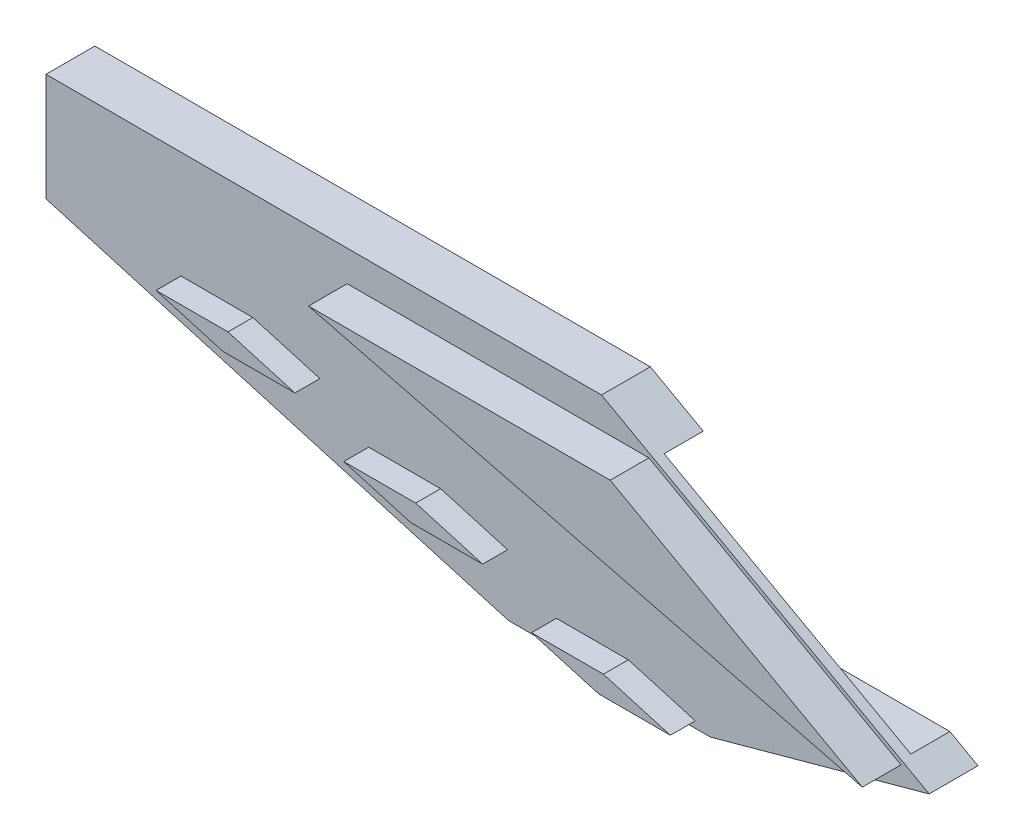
ISO-10303-21;
HEADER;
FILE_DESCRIPTION(('STEP AP214'),'2;1');
FILE_NAME('part.step','',(''),(''),'','','');
FILE_SCHEMA(('AUTOMOTIVE_DESIGN { 1 0 10303 214 1 1 1 1 }'));
ENDSEC;
DATA;
#1=APPLICATION_CONTEXT('core data for automotive mechanical design processes');
#2=APPLICATION_PROTOCOL_DEFINITION('international standard','automotive_design',2000,#1);
#3=PRODUCT_CONTEXT('',#1,'mechanical');
#4=PRODUCT('Part','Part','',(#3));
#5=PRODUCT_RELATED_PRODUCT_CATEGORY('part','',(#4));
#6=PRODUCT_DEFINITION_FORMATION('','',#4);
#7=PRODUCT_DEFINITION_CONTEXT('part definition',#1,'design');
#8=PRODUCT_DEFINITION('design','',#6,#7);
#9=PRODUCT_DEFINITION_SHAPE('','',#8);
#10=(LENGTH_UNIT() NAMED_UNIT(*) SI_UNIT(.MILLI.,.METRE.));
#11=(NAMED_UNIT(*) PLANE_ANGLE_UNIT() SI_UNIT($,.RADIAN.));
#12=(NAMED_UNIT(*) SI_UNIT($,.STERADIAN.) SOLID_ANGLE_UNIT());
#13=UNCERTAINTY_MEASURE_WITH_UNIT(LENGTH_MEASURE(1.E-05),#10,'distance_accuracy_value','');
#14=(GEOMETRIC_REPRESENTATION_CONTEXT(3) GLOBAL_UNCERTAINTY_ASSIGNED_CONTEXT((#13)) GLOBAL_UNIT_ASSIGNED_CONTEXT((#10,
#11,#12)) REPRESENTATION_CONTEXT('',''));
#15=CARTESIAN_POINT('',(0.,0.,0.));
#16=DIRECTION('',(0.,0.,1.));
#17=DIRECTION('',(1.,0.,0.));
#18=AXIS2_PLACEMENT_3D('',#15,#16,#17);
#19=CARTESIAN_POINT('',(7.36236862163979,13.2769199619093,1.27540173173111));
#20=DIRECTION('',(-0.484953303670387,-0.87454004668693,0.));
#21=DIRECTION('',(0.87454004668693,-0.484953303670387,0.));
#22=AXIS2_PLACEMENT_3D('',#19,#20,#21);
#23=PLANE('',#22);
#24=DIRECTION('',(0.,0.,1.));
#25=VECTOR('',#24,1.);
#26=CARTESIAN_POINT('',(30.6308957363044,0.373967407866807,-2.5));
#27=LINE('',#26,#25);
#28=CARTESIAN_POINT('',(30.6308957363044,0.373967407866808,-2.5));
#29=VERTEX_POINT('',#28);
#30=CARTESIAN_POINT('',(30.6308957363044,0.373967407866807,-0.5));
#31=VERTEX_POINT('',#30);
#32=EDGE_CURVE('E251',#29,#31,#27,.T.);
#33=ORIENTED_EDGE('',*,*,#32,.F.);
#34=DIRECTION('',(-0.874539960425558,0.484953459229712,0.));
#35=VECTOR('',#34,1.);
#36=CARTESIAN_POINT('',(27.9258733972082,1.87396740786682,-2.5));
#37=LINE('',#36,#35);
#38=CARTESIAN_POINT('',(27.9258733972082,1.87396740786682,-2.5));
#39=VERTEX_POINT('',#38);
#40=EDGE_CURVE('E236',#29,#39,#37,.T.);
#41=ORIENTED_EDGE('',*,*,#40,.T.);
#42=DIRECTION('',(0.,0.,1.));
#43=VECTOR('',#42,1.);
#44=CARTESIAN_POINT('',(27.9258733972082,1.87396740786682,-2.5));
#45=LINE('',#44,#43);
#46=CARTESIAN_POINT('',(27.9258733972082,1.87396740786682,0.));
#47=VERTEX_POINT('',#46);
#48=EDGE_CURVE('E393',#39,#47,#45,.T.);
#49=ORIENTED_EDGE('',*,*,#48,.T.);
#50=DIRECTION('',(0.874539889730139,-0.484953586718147,0.));
#51=VECTOR('',#50,1.);
#52=CARTESIAN_POINT('',(27.9258733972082,1.87396740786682,0.));
#53=LINE('',#52,#51);
#54=CARTESIAN_POINT('',(30.4036142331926,0.5,0.));
#55=VERTEX_POINT('',#54);
#56=EDGE_CURVE('E368',#47,#55,#53,.T.);
#57=ORIENTED_EDGE('',*,*,#56,.T.);
#58=DIRECTION('',(0.87454004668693,-0.484953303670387,0.));
#59=VECTOR('',#58,1.);
#60=CARTESIAN_POINT('',(30.4036142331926,0.500000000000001,0.));
#61=LINE('',#60,#59);
#62=CARTESIAN_POINT('',(44.6914697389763,-7.42295647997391,0.));
#63=VERTEX_POINT('',#62);
#64=EDGE_CURVE('E253',#55,#63,#61,.T.);
#65=ORIENTED_EDGE('',*,*,#64,.T.);
#66=DIRECTION('',(0.,0.,1.));
#67=VECTOR('',#66,1.);
#68=CARTESIAN_POINT('',(44.6914697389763,-7.42295647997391,-0.5));
#69=LINE('',#68,#67);
#70=CARTESIAN_POINT('',(44.6914697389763,-7.42295647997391,-2.5));
#71=VERTEX_POINT('',#70);
#72=EDGE_CURVE('E422',#71,#63,#69,.T.);
#73=ORIENTED_EDGE('',*,*,#72,.F.);
#74=DIRECTION('',(-0.87454004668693,0.484953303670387,0.));
#75=VECTOR('',#74,1.);
#76=CARTESIAN_POINT('',(41.4509888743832,-5.62603259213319,-2.5));
#77=LINE('',#76,#75);
#78=CARTESIAN_POINT('',(43.2543378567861,-6.6260325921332,-2.5));
#79=VERTEX_POINT('',#78);
#80=EDGE_CURVE('E376',#71,#79,#77,.T.);
#81=ORIENTED_EDGE('',*,*,#80,.T.);
#82=DIRECTION('',(0.,0.,1.));
#83=VECTOR('',#82,1.);
#84=CARTESIAN_POINT('',(43.2543378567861,-6.6260325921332,-2.5));
#85=LINE('',#84,#83);
#86=CARTESIAN_POINT('',(43.2543378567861,-6.6260325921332,-0.5));
#87=VERTEX_POINT('',#86);
#88=EDGE_CURVE('E260',#79,#87,#85,.T.);
#89=ORIENTED_EDGE('',*,*,#88,.T.);
#90=DIRECTION('',(-0.87454004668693,0.484953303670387,0.));
#91=VECTOR('',#90,1.);
#92=CARTESIAN_POINT('',(44.6914697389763,-7.42295647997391,-0.5));
#93=LINE('',#92,#91);
#94=CARTESIAN_POINT('',(32.4342439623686,-0.626032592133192,-0.5));
#95=VERTEX_POINT('',#94);
#96=EDGE_CURVE('E401',#87,#95,#93,.T.);
#97=ORIENTED_EDGE('',*,*,#96,.T.);
#98=DIRECTION('',(-0.874539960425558,0.484953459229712,0.));
#99=VECTOR('',#98,1.);
#100=CARTESIAN_POINT('',(32.4342439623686,-0.626032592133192,-0.5));
#101=LINE('',#100,#99);
#102=EDGE_CURVE('E265',#95,#31,#101,.T.);
#103=ORIENTED_EDGE('',*,*,#102,.T.);
#104=EDGE_LOOP('',(#33,#41,#49,#57,#65,#73,#81,#89,#97,#103));
#105=FACE_BOUND('',#104,.T.);
#106=ADVANCED_FACE('F45',(#105),#23,.F.);
#107=CARTESIAN_POINT('',(23.1646220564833,-10.5,-1.5));
#108=DIRECTION('',(0.278176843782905,0.960529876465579,0.));
#109=DIRECTION('',(-0.960529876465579,0.278176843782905,0.));
#110=AXIS2_PLACEMENT_3D('',#107,#108,#109);
#111=PLANE('',#110);
#112=DIRECTION('',(0.,0.,1.));
#113=VECTOR('',#112,1.);
#114=CARTESIAN_POINT('',(9.78801822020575,-6.6260325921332,-2.5));
#115=LINE('',#114,#113);
#116=CARTESIAN_POINT('',(9.78801822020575,-6.6260325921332,-2.5));
#117=VERTEX_POINT('',#116);
#118=CARTESIAN_POINT('',(9.78801822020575,-6.6260325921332,-0.5));
#119=VERTEX_POINT('',#118);
#120=EDGE_CURVE('E258',#117,#119,#115,.T.);
#121=ORIENTED_EDGE('',*,*,#120,.F.);
#122=DIRECTION('',(0.960529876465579,-0.278176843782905,0.));
#123=VECTOR('',#122,1.);
#124=CARTESIAN_POINT('',(6.3350712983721,-5.62603259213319,-2.5));
#125=LINE('',#124,#123);
#126=CARTESIAN_POINT('',(14.9674386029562,-8.12603259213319,-2.5));
#127=VERTEX_POINT('',#126);
#128=EDGE_CURVE('E379',#117,#127,#125,.T.);
#129=ORIENTED_EDGE('',*,*,#128,.T.);
#130=DIRECTION('',(0.,0.,1.));
#131=VECTOR('',#130,1.);
#132=CARTESIAN_POINT('',(14.9674386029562,-8.12603259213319,-2.5));
#133=LINE('',#132,#131);
#134=CARTESIAN_POINT('',(14.9674386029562,-8.1260325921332,-0.5));
#135=VERTEX_POINT('',#134);
#136=EDGE_CURVE('E371',#127,#135,#133,.T.);
#137=ORIENTED_EDGE('',*,*,#136,.T.);
#138=DIRECTION('',(0.96052987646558,-0.278176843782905,0.));
#139=VECTOR('',#138,1.);
#140=CARTESIAN_POINT('',(-1.01303723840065,-3.49796381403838,-0.5));
#141=LINE('',#140,#139);
#142=CARTESIAN_POINT('',(23.1646220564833,-10.5,-0.5));
#143=VERTEX_POINT('',#142);
#144=EDGE_CURVE('E414',#135,#143,#141,.T.);
#145=ORIENTED_EDGE('',*,*,#144,.T.);
#146=DIRECTION('',(0.,0.,1.));
#147=VECTOR('',#146,1.);
#148=CARTESIAN_POINT('',(23.1646220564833,-10.5,-1.5));
#149=LINE('',#148,#147);
#150=CARTESIAN_POINT('',(23.1646220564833,-10.5,0.));
#151=VERTEX_POINT('',#150);
#152=EDGE_CURVE('E411',#143,#151,#149,.T.);
#153=ORIENTED_EDGE('',*,*,#152,.T.);
#154=DIRECTION('',(0.960529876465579,-0.278176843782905,0.));
#155=VECTOR('',#154,1.);
#156=CARTESIAN_POINT('',(23.1646220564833,-10.5,0.));
#157=LINE('',#156,#155);
#158=CARTESIAN_POINT('',(-0.5,-3.64654334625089,0.));
#159=VERTEX_POINT('',#158);
#160=EDGE_CURVE('E407',#159,#151,#157,.T.);
#161=ORIENTED_EDGE('',*,*,#160,.F.);
#162=DIRECTION('',(0.,0.,1.));
#163=VECTOR('',#162,1.);
#164=CARTESIAN_POINT('',(-0.5,-3.64654334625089,-1.5));
#165=LINE('',#164,#163);
#166=CARTESIAN_POINT('',(-0.5,-3.64654334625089,-0.5));
#167=VERTEX_POINT('',#166);
#168=EDGE_CURVE('E410',#167,#159,#165,.T.);
#169=ORIENTED_EDGE('',*,*,#168,.F.);
#170=EDGE_CURVE('E417',#167,#119,#141,.T.);
#171=ORIENTED_EDGE('',*,*,#170,.T.);
#172=EDGE_LOOP('',(#121,#129,#137,#145,#153,#161,#169,#171));
#173=FACE_BOUND('',#172,.T.);
#174=ADVANCED_FACE('F486',(#173),#111,.F.);
#175=CARTESIAN_POINT('',(-0.5,-10.5,0.));
#176=DIRECTION('',(1.,0.,0.));
#177=DIRECTION('',(0.,0.,1.));
#178=AXIS2_PLACEMENT_3D('',#175,#176,#177);
#179=PLANE('',#178);
#180=DIRECTION('',(0.,0.,1.));
#181=VECTOR('',#180,1.);
#182=CARTESIAN_POINT('',(-0.499999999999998,0.373967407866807,-2.5));
#183=LINE('',#182,#181);
#184=CARTESIAN_POINT('',(-0.499999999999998,0.373967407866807,-2.5));
#185=VERTEX_POINT('',#184);
#186=CARTESIAN_POINT('',(-0.499999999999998,0.373967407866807,-0.5));
#187=VERTEX_POINT('',#186);
#188=EDGE_CURVE('E238',#185,#187,#183,.T.);
#189=ORIENTED_EDGE('',*,*,#188,.T.);
#190=DIRECTION('',(0.,-1.,0.));
#191=VECTOR('',#190,1.);
#192=CARTESIAN_POINT('',(-0.5,0.5,-0.5));
#193=LINE('',#192,#191);
#194=EDGE_CURVE('E396',#187,#167,#193,.T.);
#195=ORIENTED_EDGE('',*,*,#194,.T.);
#196=ORIENTED_EDGE('',*,*,#168,.T.);
#197=DIRECTION('',(0.,1.,0.));
#198=VECTOR('',#197,1.);
#199=CARTESIAN_POINT('',(-0.5,-10.5,0.));
#200=LINE('',#199,#198);
#201=CARTESIAN_POINT('',(-0.499999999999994,1.87396740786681,0.));
#202=VERTEX_POINT('',#201);
#203=EDGE_CURVE('E425',#159,#202,#200,.T.);
#204=ORIENTED_EDGE('',*,*,#203,.T.);
#205=DIRECTION('',(0.,0.,1.));
#206=VECTOR('',#205,1.);
#207=CARTESIAN_POINT('',(-0.499999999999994,1.87396740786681,-2.5));
#208=LINE('',#207,#206);
#209=CARTESIAN_POINT('',(-0.499999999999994,1.87396740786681,-2.5));
#210=VERTEX_POINT('',#209);
#211=EDGE_CURVE('E246',#210,#202,#208,.T.);
#212=ORIENTED_EDGE('',*,*,#211,.F.);
#213=DIRECTION('',(0.,-1.,0.));
#214=VECTOR('',#213,1.);
#215=CARTESIAN_POINT('',(-0.5,-0.626032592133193,-2.5));
#216=LINE('',#215,#214);
#217=EDGE_CURVE('E233',#210,#185,#216,.T.);
#218=ORIENTED_EDGE('',*,*,#217,.T.);
#219=EDGE_LOOP('',(#189,#195,#196,#204,#212,#218));
#220=FACE_BOUND('',#219,.T.);
#221=ADVANCED_FACE('F243',(#220),#179,.F.);
#222=CARTESIAN_POINT('',(0.,0.,-2.5));
#223=DIRECTION('',(0.,0.,1.));
#224=DIRECTION('',(-1.,0.,0.));
#225=AXIS2_PLACEMENT_3D('',#222,#223,#224);
#226=PLANE('',#225);
#227=DIRECTION('',(-1.,0.,0.));
#228=VECTOR('',#227,1.);
#229=CARTESIAN_POINT('',(24.7373461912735,0.373967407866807,-2.5));
#230=LINE('',#229,#228);
#231=EDGE_CURVE('E60',#29,#185,#230,.T.);
#232=ORIENTED_EDGE('',*,*,#231,.T.);
#233=ORIENTED_EDGE('',*,*,#217,.F.);
#234=DIRECTION('',(-1.,0.,0.));
#235=VECTOR('',#234,1.);
#236=CARTESIAN_POINT('',(-0.499999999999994,1.87396740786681,-2.5));
#237=LINE('',#236,#235);
#238=EDGE_CURVE('E390',#39,#210,#237,.T.);
#239=ORIENTED_EDGE('',*,*,#238,.F.);
#240=ORIENTED_EDGE('',*,*,#40,.F.);
#241=EDGE_LOOP('',(#232,#233,#239,#240));
#242=FACE_BOUND('',#241,.T.);
#243=ADVANCED_FACE('F232',(#242),#226,.F.);
#244=CARTESIAN_POINT('',(0.,0.,-2.5));
#245=DIRECTION('',(0.,0.,1.));
#246=DIRECTION('',(-1.,0.,0.));
#247=AXIS2_PLACEMENT_3D('',#244,#245,#246);
#248=PLANE('',#247);
#249=DIRECTION('',(1.,0.,0.));
#250=VECTOR('',#249,1.);
#251=CARTESIAN_POINT('',(9.78801822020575,-6.6260325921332,-2.5));
#252=LINE('',#251,#250);
#253=EDGE_CURVE('E68',#117,#79,#252,.T.);
#254=ORIENTED_EDGE('',*,*,#253,.T.);
#255=ORIENTED_EDGE('',*,*,#80,.F.);
#256=DIRECTION('',(0.964218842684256,0.265107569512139,0.));
#257=VECTOR('',#256,1.);
#258=CARTESIAN_POINT('',(44.6914697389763,-7.42295647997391,-2.5));
#259=LINE('',#258,#257);
#260=CARTESIAN_POINT('',(42.134321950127,-8.1260325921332,-2.5));
#261=VERTEX_POINT('',#260);
#262=EDGE_CURVE('E382',#261,#71,#259,.T.);
#263=ORIENTED_EDGE('',*,*,#262,.F.);
#264=DIRECTION('',(1.,0.,0.));
#265=VECTOR('',#264,1.);
#266=CARTESIAN_POINT('',(14.9674386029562,-8.12603259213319,-2.5));
#267=LINE('',#266,#265);
#268=EDGE_CURVE('E384',#127,#261,#267,.T.);
#269=ORIENTED_EDGE('',*,*,#268,.F.);
#270=ORIENTED_EDGE('',*,*,#128,.F.);
#271=EDGE_LOOP('',(#254,#255,#263,#269,#270));
#272=FACE_BOUND('',#271,.T.);
#273=ADVANCED_FACE('F505',(#272),#248,.F.);
#274=CARTESIAN_POINT('',(0.,0.,-0.5));
#275=DIRECTION('',(0.,0.,1.));
#276=DIRECTION('',(-1.,0.,0.));
#277=AXIS2_PLACEMENT_3D('',#274,#275,#276);
#278=PLANE('',#277);
#279=ORIENTED_EDGE('',*,*,#170,.F.);
#280=ORIENTED_EDGE('',*,*,#194,.F.);
#281=DIRECTION('',(-1.,0.,0.));
#282=VECTOR('',#281,1.);
#283=CARTESIAN_POINT('',(-0.499999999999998,0.373967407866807,-0.5));
#284=LINE('',#283,#282);
#285=EDGE_CURVE('E239',#31,#187,#284,.T.);
#286=ORIENTED_EDGE('',*,*,#285,.F.);
#287=ORIENTED_EDGE('',*,*,#102,.F.);
#288=ORIENTED_EDGE('',*,*,#96,.F.);
#289=DIRECTION('',(1.,0.,0.));
#290=VECTOR('',#289,1.);
#291=CARTESIAN_POINT('',(9.78801822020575,-6.6260325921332,-0.5));
#292=LINE('',#291,#290);
#293=EDGE_CURVE('E263',#119,#87,#292,.T.);
#294=ORIENTED_EDGE('',*,*,#293,.F.);
#295=EDGE_LOOP('',(#279,#280,#286,#287,#288,#294));
#296=FACE_BOUND('',#295,.T.);
#297=ADVANCED_FACE('F510',(#296),#278,.F.);
#298=DIRECTION('',(1.,0.,0.));
#299=VECTOR('',#298,1.);
#300=CARTESIAN_POINT('',(14.9674386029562,-8.12603259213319,-0.5));
#301=LINE('',#300,#299);
#302=CARTESIAN_POINT('',(42.134321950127,-8.1260325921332,-0.5));
#303=VERTEX_POINT('',#302);
#304=EDGE_CURVE('E247',#135,#303,#301,.T.);
#305=ORIENTED_EDGE('',*,*,#304,.T.);
#306=DIRECTION('',(0.964218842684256,0.265107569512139,0.));
#307=VECTOR('',#306,1.);
#308=CARTESIAN_POINT('',(33.6278108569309,-10.4648589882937,-0.5));
#309=LINE('',#308,#307);
#310=CARTESIAN_POINT('',(33.5,-10.5,-0.5));
#311=VERTEX_POINT('',#310);
#312=EDGE_CURVE('E400',#311,#303,#309,.T.);
#313=ORIENTED_EDGE('',*,*,#312,.F.);
#314=DIRECTION('',(1.,0.,0.));
#315=VECTOR('',#314,1.);
#316=CARTESIAN_POINT('',(23.1646220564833,-10.5,-0.5));
#317=LINE('',#316,#315);
#318=EDGE_CURVE('E397',#143,#311,#317,.T.);
#319=ORIENTED_EDGE('',*,*,#318,.F.);
#320=ORIENTED_EDGE('',*,*,#144,.F.);
#321=EDGE_LOOP('',(#305,#313,#319,#320));
#322=FACE_BOUND('',#321,.T.);
#323=ADVANCED_FACE('F522',(#322),#278,.F.);
#324=CARTESIAN_POINT('',(44.6914697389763,-7.42295647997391,-0.5));
#325=DIRECTION('',(-0.265107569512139,0.964218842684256,0.));
#326=DIRECTION('',(-0.964218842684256,-0.265107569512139,0.));
#327=AXIS2_PLACEMENT_3D('',#324,#325,#326);
#328=PLANE('',#327);
#329=ORIENTED_EDGE('',*,*,#312,.T.);
#330=DIRECTION('',(0.,0.,1.));
#331=VECTOR('',#330,1.);
#332=CARTESIAN_POINT('',(42.134321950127,-8.1260325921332,-2.5));
#333=LINE('',#332,#331);
#334=EDGE_CURVE('E374',#261,#303,#333,.T.);
#335=ORIENTED_EDGE('',*,*,#334,.F.);
#336=ORIENTED_EDGE('',*,*,#262,.T.);
#337=ORIENTED_EDGE('',*,*,#72,.T.);
#338=DIRECTION('',(0.964218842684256,0.265107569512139,0.));
#339=VECTOR('',#338,1.);
#340=CARTESIAN_POINT('',(44.6914697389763,-7.42295647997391,0.));
#341=LINE('',#340,#339);
#342=CARTESIAN_POINT('',(33.5,-10.5,0.));
#343=VERTEX_POINT('',#342);
#344=EDGE_CURVE('E420',#343,#63,#341,.T.);
#345=ORIENTED_EDGE('',*,*,#344,.F.);
#346=DIRECTION('',(0.,0.,-1.));
#347=VECTOR('',#346,1.);
#348=CARTESIAN_POINT('',(33.5,-10.5,0.));
#349=LINE('',#348,#347);
#350=EDGE_CURVE('E429',#343,#311,#349,.T.);
#351=ORIENTED_EDGE('',*,*,#350,.T.);
#352=EDGE_LOOP('',(#329,#335,#336,#337,#345,#351));
#353=FACE_BOUND('',#352,.T.);
#354=ADVANCED_FACE('F499',(#353),#328,.F.);
#355=CARTESIAN_POINT('',(33.5,-10.5,0.));
#356=DIRECTION('',(0.,1.,0.));
#357=DIRECTION('',(0.,0.,-1.));
#358=AXIS2_PLACEMENT_3D('',#355,#356,#357);
#359=PLANE('',#358);
#360=ORIENTED_EDGE('',*,*,#318,.T.);
#361=ORIENTED_EDGE('',*,*,#350,.F.);
#362=DIRECTION('',(-1.,0.,0.));
#363=VECTOR('',#362,1.);
#364=CARTESIAN_POINT('',(33.5,-10.5,0.));
#365=LINE('',#364,#363);
#366=EDGE_CURVE('E427',#343,#151,#365,.T.);
#367=ORIENTED_EDGE('',*,*,#366,.T.);
#368=ORIENTED_EDGE('',*,*,#152,.F.);
#369=EDGE_LOOP('',(#360,#361,#367,#368));
#370=FACE_BOUND('',#369,.T.);
#371=ADVANCED_FACE('F497',(#370),#359,.F.);
#372=CARTESIAN_POINT('',(0.,0.,0.));
#373=DIRECTION('',(0.,0.,-1.));
#374=DIRECTION('',(1.,0.,0.));
#375=AXIS2_PLACEMENT_3D('',#372,#373,#374);
#376=PLANE('',#375);
#377=ORIENTED_EDGE('',*,*,#366,.F.);
#378=ORIENTED_EDGE('',*,*,#344,.T.);
#379=ORIENTED_EDGE('',*,*,#64,.F.);
#380=ORIENTED_EDGE('',*,*,#56,.F.);
#381=DIRECTION('',(1.,0.,0.));
#382=VECTOR('',#381,1.);
#383=CARTESIAN_POINT('',(-0.499999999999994,1.87396740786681,0.));
#384=LINE('',#383,#382);
#385=EDGE_CURVE('E358',#202,#47,#384,.T.);
#386=ORIENTED_EDGE('',*,*,#385,.F.);
#387=ORIENTED_EDGE('',*,*,#203,.F.);
#388=ORIENTED_EDGE('',*,*,#160,.T.);
#389=EDGE_LOOP('',(#377,#378,#379,#380,#386,#387,#388));
#390=FACE_BOUND('',#389,.T.);
#391=DIRECTION('',(1.,0.,0.));
#392=VECTOR('',#391,1.);
#393=CARTESIAN_POINT('',(6.4079260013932,-3.61277337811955,0.));
#394=LINE('',#393,#392);
#395=CARTESIAN_POINT('',(6.4079260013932,-3.61277337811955,0.));
#396=VERTEX_POINT('',#395);
#397=CARTESIAN_POINT('',(10.0872601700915,-3.61277337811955,0.));
#398=VERTEX_POINT('',#397);
#399=EDGE_CURVE('E351',#396,#398,#394,.T.);
#400=ORIENTED_EDGE('',*,*,#399,.T.);
#401=DIRECTION('',(0.960529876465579,-0.278176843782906,0.));
#402=VECTOR('',#401,1.);
#403=CARTESIAN_POINT('',(10.0872601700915,-3.61277337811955,0.));
#404=LINE('',#403,#402);
#405=CARTESIAN_POINT('',(13.5134463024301,-4.60502324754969,0.));
#406=VERTEX_POINT('',#405);
#407=EDGE_CURVE('E320',#398,#406,#404,.T.);
#408=ORIENTED_EDGE('',*,*,#407,.T.);
#409=DIRECTION('',(-1.,0.,0.));
#410=VECTOR('',#409,1.);
#411=CARTESIAN_POINT('',(13.5134463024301,-4.60502324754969,0.));
#412=LINE('',#411,#410);
#413=CARTESIAN_POINT('',(9.83411213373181,-4.60502324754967,0.));
#414=VERTEX_POINT('',#413);
#415=EDGE_CURVE('E345',#406,#414,#412,.T.);
#416=ORIENTED_EDGE('',*,*,#415,.T.);
#417=DIRECTION('',(-0.96052987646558,0.278176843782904,0.));
#418=VECTOR('',#417,1.);
#419=CARTESIAN_POINT('',(9.83411213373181,-4.60502324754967,0.));
#420=LINE('',#419,#418);
#421=EDGE_CURVE('E348',#414,#396,#420,.T.);
#422=ORIENTED_EDGE('',*,*,#421,.T.);
#423=EDGE_LOOP('',(#400,#408,#416,#422));
#424=FACE_BOUND('',#423,.T.);
#425=DIRECTION('',(1.,0.,0.));
#426=VECTOR('',#425,1.);
#427=CARTESIAN_POINT('',(16.013224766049,-6.39454181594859,0.));
#428=LINE('',#427,#426);
#429=CARTESIAN_POINT('',(16.013224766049,-6.39454181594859,0.));
#430=VERTEX_POINT('',#429);
#431=CARTESIAN_POINT('',(19.6925589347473,-6.3945418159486,0.));
#432=VERTEX_POINT('',#431);
#433=EDGE_CURVE('E298',#430,#432,#428,.T.);
#434=ORIENTED_EDGE('',*,*,#433,.T.);
#435=DIRECTION('',(0.96052987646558,-0.278176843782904,0.));
#436=VECTOR('',#435,1.);
#437=CARTESIAN_POINT('',(19.6925589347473,-6.3945418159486,0.));
#438=LINE('',#437,#436);
#439=CARTESIAN_POINT('',(23.1187450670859,-7.38679168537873,0.));
#440=VERTEX_POINT('',#439);
#441=EDGE_CURVE('E317',#432,#440,#438,.T.);
#442=ORIENTED_EDGE('',*,*,#441,.T.);
#443=DIRECTION('',(-1.,0.,0.));
#444=VECTOR('',#443,1.);
#445=CARTESIAN_POINT('',(23.1187450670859,-7.38679168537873,0.));
#446=LINE('',#445,#444);
#447=CARTESIAN_POINT('',(19.4394108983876,-7.38679168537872,0.));
#448=VERTEX_POINT('',#447);
#449=EDGE_CURVE('E314',#440,#448,#446,.T.);
#450=ORIENTED_EDGE('',*,*,#449,.T.);
#451=DIRECTION('',(-0.960529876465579,0.278176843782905,0.));
#452=VECTOR('',#451,1.);
#453=CARTESIAN_POINT('',(19.4394108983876,-7.38679168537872,0.));
#454=LINE('',#453,#452);
#455=EDGE_CURVE('E311',#448,#430,#454,.T.);
#456=ORIENTED_EDGE('',*,*,#455,.T.);
#457=EDGE_LOOP('',(#434,#442,#450,#456));
#458=FACE_BOUND('',#457,.T.);
#459=DIRECTION('',(1.,0.,0.));
#460=VECTOR('',#459,1.);
#461=CARTESIAN_POINT('',(25.6185235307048,-9.17631025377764,0.));
#462=LINE('',#461,#460);
#463=CARTESIAN_POINT('',(25.6185235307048,-9.17631025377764,0.));
#464=VERTEX_POINT('',#463);
#465=CARTESIAN_POINT('',(29.2978576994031,-9.17631025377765,0.));
#466=VERTEX_POINT('',#465);
#467=EDGE_CURVE('E324',#464,#466,#462,.T.);
#468=ORIENTED_EDGE('',*,*,#467,.T.);
#469=DIRECTION('',(0.96052987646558,-0.278176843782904,0.));
#470=VECTOR('',#469,1.);
#471=CARTESIAN_POINT('',(29.2978576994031,-9.17631025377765,0.));
#472=LINE('',#471,#470);
#473=CARTESIAN_POINT('',(32.7240438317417,-10.1685601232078,0.));
#474=VERTEX_POINT('',#473);
#475=EDGE_CURVE('E308',#466,#474,#472,.T.);
#476=ORIENTED_EDGE('',*,*,#475,.T.);
#477=DIRECTION('',(-1.,0.,0.));
#478=VECTOR('',#477,1.);
#479=CARTESIAN_POINT('',(32.7240438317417,-10.1685601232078,0.));
#480=LINE('',#479,#478);
#481=CARTESIAN_POINT('',(29.0447096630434,-10.1685601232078,0.));
#482=VERTEX_POINT('',#481);
#483=EDGE_CURVE('E338',#474,#482,#480,.T.);
#484=ORIENTED_EDGE('',*,*,#483,.T.);
#485=DIRECTION('',(-0.960529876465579,0.278176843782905,0.));
#486=VECTOR('',#485,1.);
#487=CARTESIAN_POINT('',(29.0447096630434,-10.1685601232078,0.));
#488=LINE('',#487,#486);
#489=EDGE_CURVE('E335',#482,#464,#488,.T.);
#490=ORIENTED_EDGE('',*,*,#489,.T.);
#491=EDGE_LOOP('',(#468,#476,#484,#490));
#492=FACE_BOUND('',#491,.T.);
#493=DIRECTION('',(-0.969584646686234,0.244756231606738,0.));
#494=VECTOR('',#493,1.);
#495=CARTESIAN_POINT('',(43.2516143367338,-6.85321397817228,0.));
#496=LINE('',#495,#494);
#497=CARTESIAN_POINT('',(43.2516143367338,-6.85321397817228,0.));
#498=VERTEX_POINT('',#497);
#499=CARTESIAN_POINT('',(14.914658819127,0.3,0.));
#500=VERTEX_POINT('',#499);
#501=EDGE_CURVE('E273',#498,#500,#496,.T.);
#502=ORIENTED_EDGE('',*,*,#501,.T.);
#503=DIRECTION('',(1.,0.,0.));
#504=VECTOR('',#503,1.);
#505=CARTESIAN_POINT('',(14.914658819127,0.3,0.));
#506=LINE('',#505,#504);
#507=CARTESIAN_POINT('',(30.3518731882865,0.3,0.));
#508=VERTEX_POINT('',#507);
#509=EDGE_CURVE('E282',#500,#508,#506,.T.);
#510=ORIENTED_EDGE('',*,*,#509,.T.);
#511=DIRECTION('',(0.87454004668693,-0.484953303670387,0.));
#512=VECTOR('',#511,1.);
#513=CARTESIAN_POINT('',(30.3518731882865,0.3,0.));
#514=LINE('',#513,#512);
#515=EDGE_CURVE('E290',#508,#498,#514,.T.);
#516=ORIENTED_EDGE('',*,*,#515,.T.);
#517=EDGE_LOOP('',(#502,#510,#516));
#518=FACE_BOUND('',#517,.T.);
#519=ADVANCED_FACE('F47',(#390,#424,#458,#492,#518),#376,.F.);
#520=CARTESIAN_POINT('',(-0.499999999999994,1.87396740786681,-2.5));
#521=DIRECTION('',(0.,-1.,0.));
#522=DIRECTION('',(1.,0.,0.));
#523=AXIS2_PLACEMENT_3D('',#520,#521,#522);
#524=PLANE('',#523);
#525=ORIENTED_EDGE('',*,*,#48,.F.);
#526=ORIENTED_EDGE('',*,*,#238,.T.);
#527=ORIENTED_EDGE('',*,*,#211,.T.);
#528=ORIENTED_EDGE('',*,*,#385,.T.);
#529=EDGE_LOOP('',(#525,#526,#527,#528));
#530=FACE_BOUND('',#529,.T.);
#531=ADVANCED_FACE('F515',(#530),#524,.F.);
#532=CARTESIAN_POINT('',(14.9674386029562,-8.12603259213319,-2.5));
#533=DIRECTION('',(0.,1.,0.));
#534=DIRECTION('',(-1.,0.,0.));
#535=AXIS2_PLACEMENT_3D('',#532,#533,#534);
#536=PLANE('',#535);
#537=ORIENTED_EDGE('',*,*,#304,.F.);
#538=ORIENTED_EDGE('',*,*,#136,.F.);
#539=ORIENTED_EDGE('',*,*,#268,.T.);
#540=ORIENTED_EDGE('',*,*,#334,.T.);
#541=EDGE_LOOP('',(#537,#538,#539,#540));
#542=FACE_BOUND('',#541,.T.);
#543=ADVANCED_FACE('F517',(#542),#536,.F.);
#544=CARTESIAN_POINT('',(14.914658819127,0.3,0.));
#545=DIRECTION('',(0.,1.,0.));
#546=DIRECTION('',(0.,0.,-1.));
#547=AXIS2_PLACEMENT_3D('',#544,#545,#546);
#548=PLANE('',#547);
#549=DIRECTION('',(1.,0.,0.));
#550=VECTOR('',#549,1.);
#551=CARTESIAN_POINT('',(14.914658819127,0.3,1.98129752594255));
#552=LINE('',#551,#550);
#553=CARTESIAN_POINT('',(14.914658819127,0.3,1.98129752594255));
#554=VERTEX_POINT('',#553);
#555=CARTESIAN_POINT('',(30.3518731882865,0.300000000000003,1.98129752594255));
#556=VERTEX_POINT('',#555);
#557=EDGE_CURVE('E284',#554,#556,#552,.T.);
#558=ORIENTED_EDGE('',*,*,#557,.T.);
#559=DIRECTION('',(0.,0.,1.));
#560=VECTOR('',#559,1.);
#561=CARTESIAN_POINT('',(30.3518731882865,0.3,0.));
#562=LINE('',#561,#560);
#563=EDGE_CURVE('E270',#508,#556,#562,.T.);
#564=ORIENTED_EDGE('',*,*,#563,.F.);
#565=ORIENTED_EDGE('',*,*,#509,.F.);
#566=DIRECTION('',(0.,0.,1.));
#567=VECTOR('',#566,1.);
#568=CARTESIAN_POINT('',(14.914658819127,0.3,0.));
#569=LINE('',#568,#567);
#570=EDGE_CURVE('E269',#500,#554,#569,.T.);
#571=ORIENTED_EDGE('',*,*,#570,.T.);
#572=EDGE_LOOP('',(#558,#564,#565,#571));
#573=FACE_BOUND('',#572,.T.);
#574=ADVANCED_FACE('F590',(#573),#548,.T.);
#575=CARTESIAN_POINT('',(43.2516143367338,-6.85321397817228,0.));
#576=DIRECTION('',(-0.244756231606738,-0.969584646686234,0.));
#577=DIRECTION('',(0.969584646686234,-0.244756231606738,0.));
#578=AXIS2_PLACEMENT_3D('',#575,#576,#577);
#579=PLANE('',#578);
#580=DIRECTION('',(-0.969584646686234,0.244756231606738,0.));
#581=VECTOR('',#580,1.);
#582=CARTESIAN_POINT('',(43.2516143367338,-6.85321397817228,1.98129752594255));
#583=LINE('',#582,#581);
#584=CARTESIAN_POINT('',(43.2516143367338,-6.85321397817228,1.98129752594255));
#585=VERTEX_POINT('',#584);
#586=EDGE_CURVE('E279',#585,#554,#583,.T.);
#587=ORIENTED_EDGE('',*,*,#586,.T.);
#588=ORIENTED_EDGE('',*,*,#570,.F.);
#589=ORIENTED_EDGE('',*,*,#501,.F.);
#590=DIRECTION('',(0.,0.,1.));
#591=VECTOR('',#590,1.);
#592=CARTESIAN_POINT('',(43.2516143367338,-6.85321397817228,0.));
#593=LINE('',#592,#591);
#594=EDGE_CURVE('E274',#498,#585,#593,.T.);
#595=ORIENTED_EDGE('',*,*,#594,.T.);
#596=EDGE_LOOP('',(#587,#588,#589,#595));
#597=FACE_BOUND('',#596,.T.);
#598=ADVANCED_FACE('F565',(#597),#579,.T.);
#599=CARTESIAN_POINT('',(30.3518731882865,0.3,0.));
#600=DIRECTION('',(0.484953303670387,0.87454004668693,0.));
#601=DIRECTION('',(-0.87454004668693,0.484953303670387,0.));
#602=AXIS2_PLACEMENT_3D('',#599,#600,#601);
#603=PLANE('',#602);
#604=DIRECTION('',(0.87454004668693,-0.484953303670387,0.));
#605=VECTOR('',#604,1.);
#606=CARTESIAN_POINT('',(30.3518731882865,0.3,1.98129752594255));
#607=LINE('',#606,#605);
#608=EDGE_CURVE('E281',#556,#585,#607,.T.);
#609=ORIENTED_EDGE('',*,*,#608,.T.);
#610=ORIENTED_EDGE('',*,*,#594,.F.);
#611=ORIENTED_EDGE('',*,*,#515,.F.);
#612=ORIENTED_EDGE('',*,*,#563,.T.);
#613=EDGE_LOOP('',(#609,#610,#611,#612));
#614=FACE_BOUND('',#613,.T.);
#615=ADVANCED_FACE('F587',(#614),#603,.T.);
#616=CARTESIAN_POINT('',(10.0872601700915,-3.61277337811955,0.));
#617=DIRECTION('',(0.278176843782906,0.960529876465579,0.));
#618=DIRECTION('',(-0.960529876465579,0.278176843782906,0.));
#619=AXIS2_PLACEMENT_3D('',#616,#617,#618);
#620=PLANE('',#619);
#621=DIRECTION('',(-0.960529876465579,0.278176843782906,0.));
#622=VECTOR('',#621,1.);
#623=CARTESIAN_POINT('',(-0.18474685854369,-0.637921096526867,1.27540173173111));
#624=LINE('',#623,#622);
#625=CARTESIAN_POINT('',(13.5134463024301,-4.60502324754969,1.27540173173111));
#626=VERTEX_POINT('',#625);
#627=CARTESIAN_POINT('',(10.0872601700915,-3.61277337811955,1.27540173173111));
#628=VERTEX_POINT('',#627);
#629=EDGE_CURVE('E439',#626,#628,#624,.T.);
#630=ORIENTED_EDGE('',*,*,#629,.F.);
#631=DIRECTION('',(0.,0.,1.));
#632=VECTOR('',#631,1.);
#633=CARTESIAN_POINT('',(13.5134463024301,-4.60502324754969,0.));
#634=LINE('',#633,#632);
#635=EDGE_CURVE('E354',#406,#626,#634,.T.);
#636=ORIENTED_EDGE('',*,*,#635,.F.);
#637=ORIENTED_EDGE('',*,*,#407,.F.);
#638=DIRECTION('',(0.,0.,1.));
#639=VECTOR('',#638,1.);
#640=CARTESIAN_POINT('',(10.0872601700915,-3.61277337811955,0.));
#641=LINE('',#640,#639);
#642=EDGE_CURVE('E355',#398,#628,#641,.T.);
#643=ORIENTED_EDGE('',*,*,#642,.T.);
#644=EDGE_LOOP('',(#630,#636,#637,#643));
#645=FACE_BOUND('',#644,.T.);
#646=ADVANCED_FACE('F581',(#645),#620,.T.);
#647=CARTESIAN_POINT('',(6.4079260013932,-3.61277337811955,0.));
#648=DIRECTION('',(0.,1.,0.));
#649=DIRECTION('',(0.,0.,-1.));
#650=AXIS2_PLACEMENT_3D('',#647,#648,#649);
#651=PLANE('',#650);
#652=DIRECTION('',(-1.,0.,0.));
#653=VECTOR('',#652,1.);
#654=CARTESIAN_POINT('',(0.,-3.61277337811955,1.27540173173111));
#655=LINE('',#654,#653);
#656=CARTESIAN_POINT('',(6.4079260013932,-3.61277337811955,1.27540173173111));
#657=VERTEX_POINT('',#656);
#658=EDGE_CURVE('E436',#628,#657,#655,.T.);
#659=ORIENTED_EDGE('',*,*,#658,.F.);
#660=ORIENTED_EDGE('',*,*,#642,.F.);
#661=ORIENTED_EDGE('',*,*,#399,.F.);
#662=DIRECTION('',(0.,0.,1.));
#663=VECTOR('',#662,1.);
#664=CARTESIAN_POINT('',(6.4079260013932,-3.61277337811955,0.));
#665=LINE('',#664,#663);
#666=EDGE_CURVE('E359',#396,#657,#665,.T.);
#667=ORIENTED_EDGE('',*,*,#666,.T.);
#668=EDGE_LOOP('',(#659,#660,#661,#667));
#669=FACE_BOUND('',#668,.T.);
#670=ADVANCED_FACE('F578',(#669),#651,.T.);
#671=CARTESIAN_POINT('',(9.83411213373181,-4.60502324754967,0.));
#672=DIRECTION('',(-0.278176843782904,-0.96052987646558,0.));
#673=DIRECTION('',(0.96052987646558,-0.278176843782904,0.));
#674=AXIS2_PLACEMENT_3D('',#671,#672,#673);
#675=PLANE('',#674);
#676=DIRECTION('',(0.96052987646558,-0.278176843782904,0.));
#677=VECTOR('',#676,1.);
#678=CARTESIAN_POINT('',(-0.46946240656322,-1.62102877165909,1.27540173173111));
#679=LINE('',#678,#677);
#680=CARTESIAN_POINT('',(9.83411213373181,-4.60502324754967,1.27540173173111));
#681=VERTEX_POINT('',#680);
#682=EDGE_CURVE('E433',#657,#681,#679,.T.);
#683=ORIENTED_EDGE('',*,*,#682,.F.);
#684=ORIENTED_EDGE('',*,*,#666,.F.);
#685=ORIENTED_EDGE('',*,*,#421,.F.);
#686=DIRECTION('',(0.,0.,1.));
#687=VECTOR('',#686,1.);
#688=CARTESIAN_POINT('',(9.83411213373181,-4.60502324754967,0.));
#689=LINE('',#688,#687);
#690=EDGE_CURVE('E362',#414,#681,#689,.T.);
#691=ORIENTED_EDGE('',*,*,#690,.T.);
#692=EDGE_LOOP('',(#683,#684,#685,#691));
#693=FACE_BOUND('',#692,.T.);
#694=ADVANCED_FACE('F560',(#693),#675,.T.);
#695=CARTESIAN_POINT('',(13.5134463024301,-4.60502324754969,0.));
#696=DIRECTION('',(0.,-1.,0.));
#697=DIRECTION('',(1.,0.,0.));
#698=AXIS2_PLACEMENT_3D('',#695,#696,#697);
#699=PLANE('',#698);
#700=DIRECTION('',(1.,0.,0.));
#701=VECTOR('',#700,1.);
#702=CARTESIAN_POINT('',(0.,-4.60502324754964,1.27540173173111));
#703=LINE('',#702,#701);
#704=EDGE_CURVE('E431',#681,#626,#703,.T.);
#705=ORIENTED_EDGE('',*,*,#704,.F.);
#706=ORIENTED_EDGE('',*,*,#690,.F.);
#707=ORIENTED_EDGE('',*,*,#415,.F.);
#708=ORIENTED_EDGE('',*,*,#635,.T.);
#709=EDGE_LOOP('',(#705,#706,#707,#708));
#710=FACE_BOUND('',#709,.T.);
#711=ADVANCED_FACE('F553',(#710),#699,.T.);
#712=CARTESIAN_POINT('',(19.6925589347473,-6.3945418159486,0.));
#713=DIRECTION('',(0.278176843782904,0.96052987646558,0.));
#714=DIRECTION('',(-0.96052987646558,0.278176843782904,0.));
#715=AXIS2_PLACEMENT_3D('',#712,#713,#714);
#716=PLANE('',#715);
#717=DIRECTION('',(0.,0.,1.));
#718=VECTOR('',#717,1.);
#719=CARTESIAN_POINT('',(19.6925589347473,-6.3945418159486,0.));
#720=LINE('',#719,#718);
#721=CARTESIAN_POINT('',(19.6925589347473,-6.3945418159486,1.27540173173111));
#722=VERTEX_POINT('',#721);
#723=EDGE_CURVE('E305',#432,#722,#720,.T.);
#724=ORIENTED_EDGE('',*,*,#723,.T.);
#725=DIRECTION('',(0.96052987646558,-0.278176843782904,0.));
#726=VECTOR('',#725,1.);
#727=CARTESIAN_POINT('',(-0.184746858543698,-0.6379210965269,1.27540173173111));
#728=LINE('',#727,#726);
#729=CARTESIAN_POINT('',(23.1187450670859,-7.38679168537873,1.27540173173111));
#730=VERTEX_POINT('',#729);
#731=EDGE_CURVE('E448',#722,#730,#728,.T.);
#732=ORIENTED_EDGE('',*,*,#731,.T.);
#733=DIRECTION('',(0.,0.,1.));
#734=VECTOR('',#733,1.);
#735=CARTESIAN_POINT('',(23.1187450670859,-7.38679168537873,0.));
#736=LINE('',#735,#734);
#737=EDGE_CURVE('E295',#440,#730,#736,.T.);
#738=ORIENTED_EDGE('',*,*,#737,.F.);
#739=ORIENTED_EDGE('',*,*,#441,.F.);
#740=EDGE_LOOP('',(#724,#732,#738,#739));
#741=FACE_BOUND('',#740,.T.);
#742=ADVANCED_FACE('F551',(#741),#716,.T.);
#743=CARTESIAN_POINT('',(16.013224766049,-6.39454181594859,0.));
#744=DIRECTION('',(0.,1.,0.));
#745=DIRECTION('',(-1.,0.,0.));
#746=AXIS2_PLACEMENT_3D('',#743,#744,#745);
#747=PLANE('',#746);
#748=DIRECTION('',(0.,0.,1.));
#749=VECTOR('',#748,1.);
#750=CARTESIAN_POINT('',(16.013224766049,-6.39454181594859,0.));
#751=LINE('',#750,#749);
#752=CARTESIAN_POINT('',(16.013224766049,-6.39454181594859,1.27540173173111));
#753=VERTEX_POINT('',#752);
#754=EDGE_CURVE('E302',#430,#753,#751,.T.);
#755=ORIENTED_EDGE('',*,*,#754,.T.);
#756=DIRECTION('',(1.,0.,0.));
#757=VECTOR('',#756,1.);
#758=CARTESIAN_POINT('',(0.,-6.39454181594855,1.27540173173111));
#759=LINE('',#758,#757);
#760=EDGE_CURVE('E446',#753,#722,#759,.T.);
#761=ORIENTED_EDGE('',*,*,#760,.T.);
#762=ORIENTED_EDGE('',*,*,#723,.F.);
#763=ORIENTED_EDGE('',*,*,#433,.F.);
#764=EDGE_LOOP('',(#755,#761,#762,#763));
#765=FACE_BOUND('',#764,.T.);
#766=ADVANCED_FACE('F541',(#765),#747,.T.);
#767=CARTESIAN_POINT('',(19.4394108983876,-7.38679168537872,0.));
#768=DIRECTION('',(-0.278176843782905,-0.960529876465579,0.));
#769=DIRECTION('',(0.96052987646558,-0.278176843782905,0.));
#770=AXIS2_PLACEMENT_3D('',#767,#768,#769);
#771=PLANE('',#770);
#772=DIRECTION('',(0.,0.,1.));
#773=VECTOR('',#772,1.);
#774=CARTESIAN_POINT('',(19.4394108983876,-7.38679168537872,0.));
#775=LINE('',#774,#773);
#776=CARTESIAN_POINT('',(19.4394108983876,-7.38679168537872,1.27540173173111));
#777=VERTEX_POINT('',#776);
#778=EDGE_CURVE('E299',#448,#777,#775,.T.);
#779=ORIENTED_EDGE('',*,*,#778,.T.);
#780=DIRECTION('',(-0.96052987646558,0.278176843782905,0.));
#781=VECTOR('',#780,1.);
#782=CARTESIAN_POINT('',(-0.469462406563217,-1.62102877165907,1.27540173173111));
#783=LINE('',#782,#781);
#784=EDGE_CURVE('E444',#777,#753,#783,.T.);
#785=ORIENTED_EDGE('',*,*,#784,.T.);
#786=ORIENTED_EDGE('',*,*,#754,.F.);
#787=ORIENTED_EDGE('',*,*,#455,.F.);
#788=EDGE_LOOP('',(#779,#785,#786,#787));
#789=FACE_BOUND('',#788,.T.);
#790=ADVANCED_FACE('F544',(#789),#771,.T.);
#791=CARTESIAN_POINT('',(23.1187450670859,-7.38679168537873,0.));
#792=DIRECTION('',(0.,-1.,0.));
#793=DIRECTION('',(1.,0.,0.));
#794=AXIS2_PLACEMENT_3D('',#791,#792,#793);
#795=PLANE('',#794);
#796=ORIENTED_EDGE('',*,*,#737,.T.);
#797=DIRECTION('',(-1.,0.,0.));
#798=VECTOR('',#797,1.);
#799=CARTESIAN_POINT('',(0.,-7.38679168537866,1.27540173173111));
#800=LINE('',#799,#798);
#801=EDGE_CURVE('E442',#730,#777,#800,.T.);
#802=ORIENTED_EDGE('',*,*,#801,.T.);
#803=ORIENTED_EDGE('',*,*,#778,.F.);
#804=ORIENTED_EDGE('',*,*,#449,.F.);
#805=EDGE_LOOP('',(#796,#802,#803,#804));
#806=FACE_BOUND('',#805,.T.);
#807=ADVANCED_FACE('F549',(#806),#795,.T.);
#808=CARTESIAN_POINT('',(29.2978576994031,-9.17631025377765,0.));
#809=DIRECTION('',(0.278176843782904,0.96052987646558,0.));
#810=DIRECTION('',(-0.96052987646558,0.278176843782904,0.));
#811=AXIS2_PLACEMENT_3D('',#808,#809,#810);
#812=PLANE('',#811);
#813=DIRECTION('',(0.,0.,1.));
#814=VECTOR('',#813,1.);
#815=CARTESIAN_POINT('',(29.2978576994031,-9.17631025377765,0.));
#816=LINE('',#815,#814);
#817=CARTESIAN_POINT('',(29.2978576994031,-9.17631025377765,1.27540173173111));
#818=VERTEX_POINT('',#817);
#819=EDGE_CURVE('E287',#466,#818,#816,.T.);
#820=ORIENTED_EDGE('',*,*,#819,.T.);
#821=DIRECTION('',(0.96052987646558,-0.278176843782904,0.));
#822=VECTOR('',#821,1.);
#823=CARTESIAN_POINT('',(-0.184746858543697,-0.637921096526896,1.27540173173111));
#824=LINE('',#823,#822);
#825=CARTESIAN_POINT('',(32.7240438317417,-10.1685601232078,1.27540173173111));
#826=VERTEX_POINT('',#825);
#827=EDGE_CURVE('E11',#818,#826,#824,.T.);
#828=ORIENTED_EDGE('',*,*,#827,.T.);
#829=DIRECTION('',(0.,0.,1.));
#830=VECTOR('',#829,1.);
#831=CARTESIAN_POINT('',(32.7240438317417,-10.1685601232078,0.));
#832=LINE('',#831,#830);
#833=EDGE_CURVE('E321',#474,#826,#832,.T.);
#834=ORIENTED_EDGE('',*,*,#833,.F.);
#835=ORIENTED_EDGE('',*,*,#475,.F.);
#836=EDGE_LOOP('',(#820,#828,#834,#835));
#837=FACE_BOUND('',#836,.T.);
#838=ADVANCED_FACE('F464',(#837),#812,.T.);
#839=CARTESIAN_POINT('',(25.6185235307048,-9.17631025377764,0.));
#840=DIRECTION('',(0.,1.,0.));
#841=DIRECTION('',(-1.,0.,0.));
#842=AXIS2_PLACEMENT_3D('',#839,#840,#841);
#843=PLANE('',#842);
#844=DIRECTION('',(0.,0.,1.));
#845=VECTOR('',#844,1.);
#846=CARTESIAN_POINT('',(25.6185235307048,-9.17631025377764,0.));
#847=LINE('',#846,#845);
#848=CARTESIAN_POINT('',(25.6185235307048,-9.17631025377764,1.27540173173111));
#849=VERTEX_POINT('',#848);
#850=EDGE_CURVE('E328',#464,#849,#847,.T.);
#851=ORIENTED_EDGE('',*,*,#850,.T.);
#852=DIRECTION('',(1.,0.,0.));
#853=VECTOR('',#852,1.);
#854=CARTESIAN_POINT('',(0.,-9.17631025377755,1.27540173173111));
#855=LINE('',#854,#853);
#856=EDGE_CURVE('E53',#849,#818,#855,.T.);
#857=ORIENTED_EDGE('',*,*,#856,.T.);
#858=ORIENTED_EDGE('',*,*,#819,.F.);
#859=ORIENTED_EDGE('',*,*,#467,.F.);
#860=EDGE_LOOP('',(#851,#857,#858,#859));
#861=FACE_BOUND('',#860,.T.);
#862=ADVANCED_FACE('F457',(#861),#843,.T.);
#863=CARTESIAN_POINT('',(29.0447096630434,-10.1685601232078,0.));
#864=DIRECTION('',(-0.278176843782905,-0.960529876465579,0.));
#865=DIRECTION('',(0.96052987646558,-0.278176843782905,0.));
#866=AXIS2_PLACEMENT_3D('',#863,#864,#865);
#867=PLANE('',#866);
#868=DIRECTION('',(0.,0.,1.));
#869=VECTOR('',#868,1.);
#870=CARTESIAN_POINT('',(29.0447096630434,-10.1685601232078,0.));
#871=LINE('',#870,#869);
#872=CARTESIAN_POINT('',(29.0447096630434,-10.1685601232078,1.27540173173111));
#873=VERTEX_POINT('',#872);
#874=EDGE_CURVE('E325',#482,#873,#871,.T.);
#875=ORIENTED_EDGE('',*,*,#874,.T.);
#876=DIRECTION('',(-0.96052987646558,0.278176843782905,0.));
#877=VECTOR('',#876,1.);
#878=CARTESIAN_POINT('',(-0.469462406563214,-1.62102877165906,1.27540173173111));
#879=LINE('',#878,#877);
#880=EDGE_CURVE('E453',#873,#849,#879,.T.);
#881=ORIENTED_EDGE('',*,*,#880,.T.);
#882=ORIENTED_EDGE('',*,*,#850,.F.);
#883=ORIENTED_EDGE('',*,*,#489,.F.);
#884=EDGE_LOOP('',(#875,#881,#882,#883));
#885=FACE_BOUND('',#884,.T.);
#886=ADVANCED_FACE('F470',(#885),#867,.T.);
#887=CARTESIAN_POINT('',(32.7240438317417,-10.1685601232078,0.));
#888=DIRECTION('',(0.,-1.,0.));
#889=DIRECTION('',(0.,0.,1.));
#890=AXIS2_PLACEMENT_3D('',#887,#888,#889);
#891=PLANE('',#890);
#892=ORIENTED_EDGE('',*,*,#833,.T.);
#893=DIRECTION('',(-1.,0.,0.));
#894=VECTOR('',#893,1.);
#895=CARTESIAN_POINT('',(0.,-10.1685601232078,1.27540173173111));
#896=LINE('',#895,#894);
#897=EDGE_CURVE('E451',#826,#873,#896,.T.);
#898=ORIENTED_EDGE('',*,*,#897,.T.);
#899=ORIENTED_EDGE('',*,*,#874,.F.);
#900=ORIENTED_EDGE('',*,*,#483,.F.);
#901=EDGE_LOOP('',(#892,#898,#899,#900));
#902=FACE_BOUND('',#901,.T.);
#903=ADVANCED_FACE('F472',(#902),#891,.T.);
#904=CARTESIAN_POINT('',(0.,0.,1.98129752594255));
#905=DIRECTION('',(0.,0.,-1.));
#906=DIRECTION('',(1.,0.,0.));
#907=AXIS2_PLACEMENT_3D('',#904,#905,#906);
#908=PLANE('',#907);
#909=ORIENTED_EDGE('',*,*,#557,.F.);
#910=ORIENTED_EDGE('',*,*,#586,.F.);
#911=ORIENTED_EDGE('',*,*,#608,.F.);
#912=EDGE_LOOP('',(#909,#910,#911));
#913=FACE_BOUND('',#912,.T.);
#914=ADVANCED_FACE('F474',(#913),#908,.F.);
#915=CARTESIAN_POINT('',(0.,0.,1.27540173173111));
#916=DIRECTION('',(0.,0.,-1.));
#917=DIRECTION('',(1.,0.,0.));
#918=AXIS2_PLACEMENT_3D('',#915,#916,#917);
#919=PLANE('',#918);
#920=ORIENTED_EDGE('',*,*,#629,.T.);
#921=ORIENTED_EDGE('',*,*,#658,.T.);
#922=ORIENTED_EDGE('',*,*,#682,.T.);
#923=ORIENTED_EDGE('',*,*,#704,.T.);
#924=EDGE_LOOP('',(#920,#921,#922,#923));
#925=FACE_BOUND('',#924,.T.);
#926=ADVANCED_FACE('F480',(#925),#919,.F.);
#927=CARTESIAN_POINT('',(0.,0.,1.27540173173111));
#928=DIRECTION('',(0.,0.,1.));
#929=DIRECTION('',(-1.,0.,0.));
#930=AXIS2_PLACEMENT_3D('',#927,#928,#929);
#931=PLANE('',#930);
#932=ORIENTED_EDGE('',*,*,#760,.F.);
#933=ORIENTED_EDGE('',*,*,#784,.F.);
#934=ORIENTED_EDGE('',*,*,#801,.F.);
#935=ORIENTED_EDGE('',*,*,#731,.F.);
#936=EDGE_LOOP('',(#932,#933,#934,#935));
#937=FACE_BOUND('',#936,.T.);
#938=ADVANCED_FACE('F528',(#937),#931,.T.);
#939=CARTESIAN_POINT('',(0.,0.,1.27540173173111));
#940=DIRECTION('',(0.,0.,1.));
#941=DIRECTION('',(-1.,0.,0.));
#942=AXIS2_PLACEMENT_3D('',#939,#940,#941);
#943=PLANE('',#942);
#944=ORIENTED_EDGE('',*,*,#856,.F.);
#945=ORIENTED_EDGE('',*,*,#880,.F.);
#946=ORIENTED_EDGE('',*,*,#897,.F.);
#947=ORIENTED_EDGE('',*,*,#827,.F.);
#948=EDGE_LOOP('',(#944,#945,#946,#947));
#949=FACE_BOUND('',#948,.T.);
#950=ADVANCED_FACE('F462',(#949),#943,.T.);
#951=CARTESIAN_POINT('',(9.78801822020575,-6.6260325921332,-2.5));
#952=DIRECTION('',(0.,1.,0.));
#953=DIRECTION('',(-1.,0.,0.));
#954=AXIS2_PLACEMENT_3D('',#951,#952,#953);
#955=PLANE('',#954);
#956=ORIENTED_EDGE('',*,*,#293,.T.);
#957=ORIENTED_EDGE('',*,*,#88,.F.);
#958=ORIENTED_EDGE('',*,*,#253,.F.);
#959=ORIENTED_EDGE('',*,*,#120,.T.);
#960=EDGE_LOOP('',(#956,#957,#958,#959));
#961=FACE_BOUND('',#960,.T.);
#962=ADVANCED_FACE('F535',(#961),#955,.T.);
#963=CARTESIAN_POINT('',(-0.499999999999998,0.373967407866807,-2.5));
#964=DIRECTION('',(0.,-1.,0.));
#965=DIRECTION('',(0.,0.,1.));
#966=AXIS2_PLACEMENT_3D('',#963,#964,#965);
#967=PLANE('',#966);
#968=ORIENTED_EDGE('',*,*,#285,.T.);
#969=ORIENTED_EDGE('',*,*,#188,.F.);
#970=ORIENTED_EDGE('',*,*,#231,.F.);
#971=ORIENTED_EDGE('',*,*,#32,.T.);
#972=EDGE_LOOP('',(#968,#969,#970,#971));
#973=FACE_BOUND('',#972,.T.);
#974=ADVANCED_FACE('F249',(#973),#967,.T.);
#975=CLOSED_SHELL('',(#106,#174,#221,#243,#273,#297,#323,#354,#371,#519,#531,#543,#574,#598,
#615,#646,#670,#694,#711,#742,#766,#790,#807,#838,#862,#886,#903,#914,#926,#938,#950,#962,#974));
#976=MANIFOLD_SOLID_BREP('B2',#975);
#977=ADVANCED_BREP_SHAPE_REPRESENTATION('',(#18,#976),#14);
#978=SHAPE_DEFINITION_REPRESENTATION(#9,#977);
ENDSEC;
END-ISO-10303-21;
